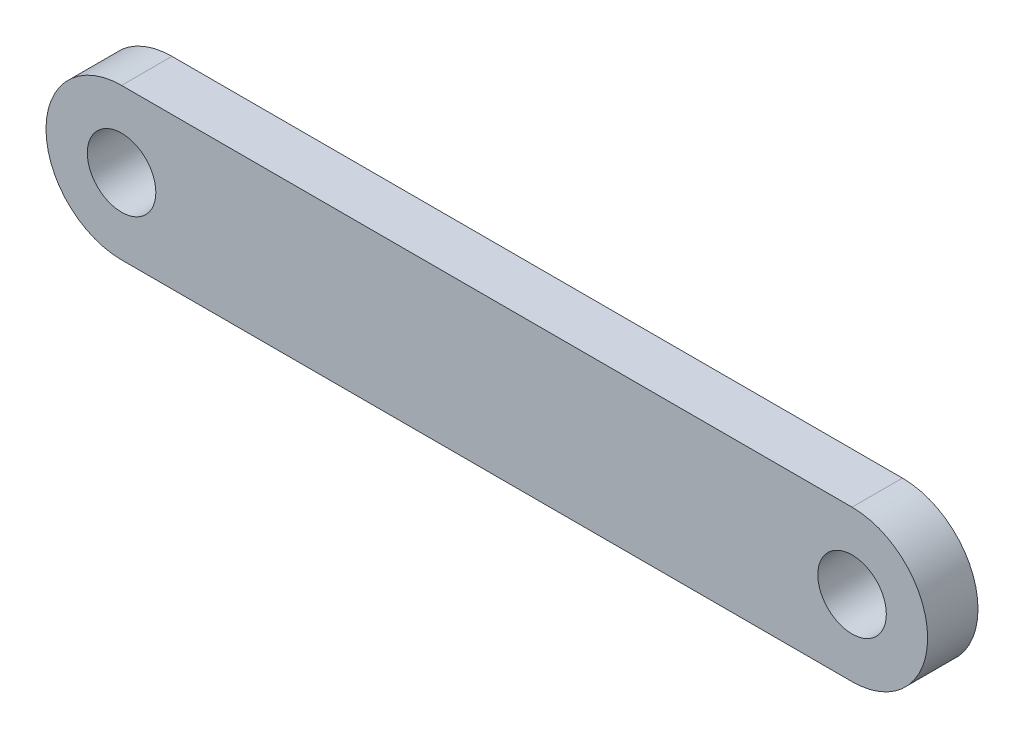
from build123d import *

# Parameters (mm, degrees)
BOSS_EXTRUDE1_DEPTH       = 2.54
F_4_CLEARANCE_HOLE1_D     = 3.4544
F_4_CLEARANCE_HOLE1_DEPTH = 6.35
F_4_CLEARANCE_HOLE1_TIP   = 1.037806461


with BuildPart() as part:
    # Sketch1 → Boss-Extrude1 (new body)
    with BuildSketch(Plane.XY):
        with BuildLine():
            Line((-47.625, 27.305), (-10.795, 27.305))
            ThreePointArc((-10.795, 27.305), (-6.985, 23.495), (-10.795, 19.685))
            Line((-10.795, 19.685), (-47.625, 19.685))
            ThreePointArc((-47.625, 19.685), (-51.435, 23.495), (-47.625, 27.305))
        make_face()
    extrude(amount=BOSS_EXTRUDE1_DEPTH)

    # 4 Clearance Hole1
    with Locations(Plane.XY.offset(2.54)):
        with Locations((-47.625, 23.495), (-10.795, 23.495)):
            Hole(F_4_CLEARANCE_HOLE1_D / 2, depth=F_4_CLEARANCE_HOLE1_DEPTH)
            with Locations((0, 0, -(F_4_CLEARANCE_HOLE1_DEPTH + F_4_CLEARANCE_HOLE1_TIP / 2))):  # 118° drill point
                Cone(0, F_4_CLEARANCE_HOLE1_D / 2, F_4_CLEARANCE_HOLE1_TIP, mode=Mode.SUBTRACT)


solid = part.part
